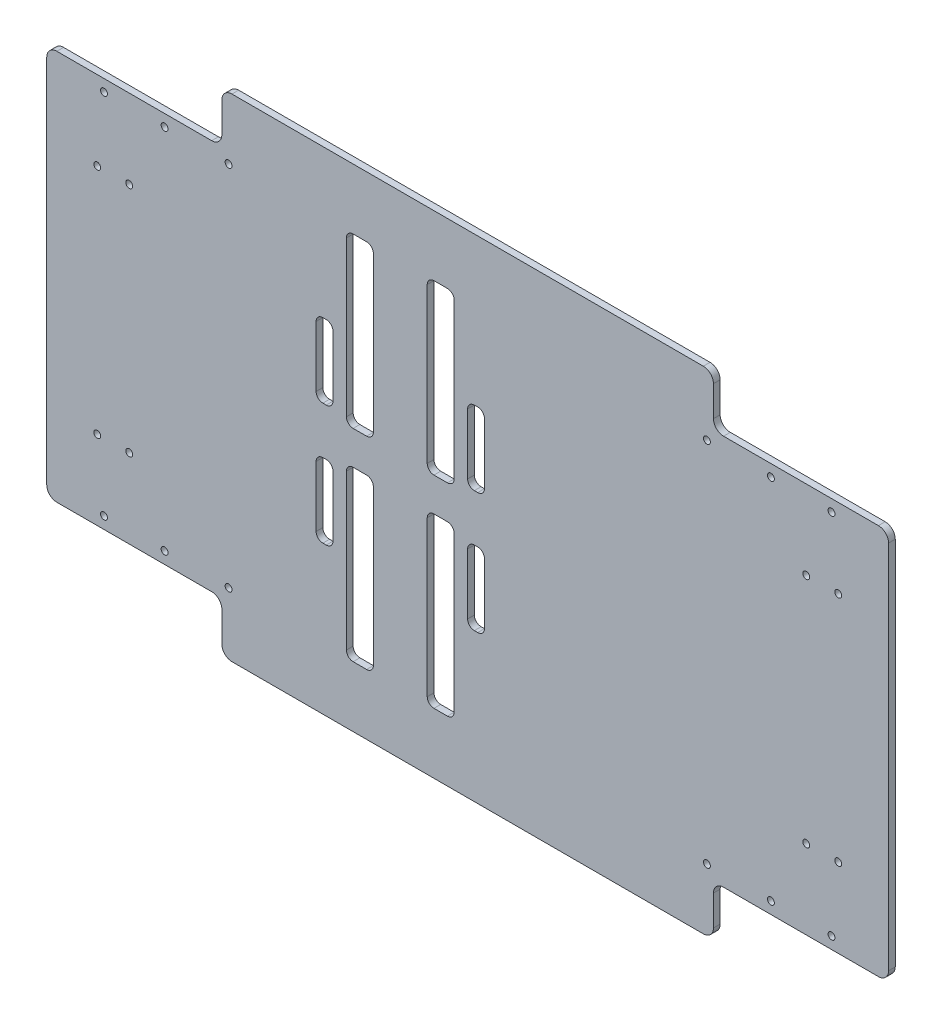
from build123d import *

# Parameters (mm, degrees)
SKETCH_1_W               = 8
SKETCH_1_H               = 50
SKETCH_1_W_2             = 5
SKETCH_1_H_2             = 22
EXTRUDE_1_DEPTH          = 2
FILLET_1_R               = 3
FILLET_2_R               = 2
HOLE_WIZARD_M2_5_1_D     = 2.05
HOLE_WIZARD_M2_5_1_DEPTH = 2
HOLE_WIZARD_M2_5_1_TIP   = 0.615882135
HOLE_WIZARD_M2_5_2_D     = 2.05
HOLE_WIZARD_M2_5_2_DEPTH = 3.35
HOLE_WIZARD_M2_5_2_TIP   = 0.615882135


with BuildPart() as part:
    # Sketch 1 → Extrude 1 (new body)
    with BuildSketch(Plane.XY):
        Polygon((73, 73), (-73, 73), (-73, 58), (-125, 58), (-125, -58), (-73, -58), (-73, -73), (73, -73), (73, -58), (125, -58), (125, 58), (73, 58), align=None)
        with Locations((-32, -30)):
            Rectangle(SKETCH_1_W, SKETCH_1_H, mode=Mode.SUBTRACT)
        with Locations((-8, -30)):
            Rectangle(SKETCH_1_W, SKETCH_1_H, mode=Mode.SUBTRACT)
        with Locations((-42.5, -18)):
            Rectangle(SKETCH_1_W_2, SKETCH_1_H_2, mode=Mode.SUBTRACT)
        with Locations((2.5, -18)):
            Rectangle(SKETCH_1_W_2, SKETCH_1_H_2, mode=Mode.SUBTRACT)
        with Locations((-42.5, 18)):
            Rectangle(SKETCH_1_W_2, SKETCH_1_H_2, mode=Mode.SUBTRACT)
        with Locations((-32, 30)):
            Rectangle(SKETCH_1_W, SKETCH_1_H, mode=Mode.SUBTRACT)
        with Locations((-8, 30)):
            Rectangle(SKETCH_1_W, SKETCH_1_H, mode=Mode.SUBTRACT)
        with Locations((2.5, 18)):
            Rectangle(SKETCH_1_W_2, SKETCH_1_H_2, mode=Mode.SUBTRACT)
    extrude(amount=EXTRUDE_1_DEPTH)

    # Fillet 1
    fillet_1_edges = [part.edges().sort_by_distance(p)[0] for p in [
        (125, -58, 1),
        (73, -58, 1),
        (73, -73, 1),
        (-73, -73, 1),
        (-73, -58, 1),
        (-125, -58, 1),
        (-125, 58, 1),
        (-73, 58, 1),
        (-73, 73, 1),
        (73, 73, 1),
        (73, 58, 1),
        (125, 58, 1),
    ]]
    fillet(fillet_1_edges, radius=FILLET_1_R)

    # Fillet 2
    fillet_2_edges = [part.edges().sort_by_distance(p)[0] for p in [
        (-28, -55, 1),
        (-28, -5, 1),
        (-36, -5, 1),
        (-36, -55, 1),
        (-40, -29, 1),
        (-40, -7, 1),
        (-45, -7, 1),
        (-45, -29, 1),
        (-12, 55, 1),
        (-12, 5, 1),
        (-4, 5, 1),
        (-4, 55, 1),
        (0, 29, 1),
        (0, 7, 1),
        (5, 7, 1),
        (5, 29, 1),
        (-45, 29, 1),
        (-45, 7, 1),
        (-40, 7, 1),
        (-40, 29, 1),
        (-36, 55, 1),
        (-36, 5, 1),
        (-28, 5, 1),
        (-28, 55, 1),
        (0, -7, 1),
        (0, -29, 1),
        (5, -29, 1),
        (5, -7, 1),
        (-12, -5, 1),
        (-12, -55, 1),
        (-4, -55, 1),
        (-4, -5, 1),
    ]]
    fillet(fillet_2_edges, radius=FILLET_2_R)

    # Hole Wizard M2.5 _1
    with Locations(Plane(origin=(0, 0, 0), x_dir=(-1, 0, 0), z_dir=(0, 0, -1))):
        with Locations((110, 34.5), (100.5, 34.5), (108, 54.5), (90, 54.5), (71, 54.5), (110, -34.5), (100.5, -34.5), (71, -54.5), (90, -54.5), (108, -54.5)):
            Hole(HOLE_WIZARD_M2_5_1_D / 2, depth=HOLE_WIZARD_M2_5_1_DEPTH)
            with Locations((0, 0, -(HOLE_WIZARD_M2_5_1_DEPTH + HOLE_WIZARD_M2_5_1_TIP / 2))):  # 118° drill point
                Cone(0, HOLE_WIZARD_M2_5_1_D / 2, HOLE_WIZARD_M2_5_1_TIP, mode=Mode.SUBTRACT)

    # Hole Wizard M2.5 _2
    with Locations(Plane(origin=(0, 0, 0), x_dir=(-1, 0, 0), z_dir=(0, 0, -1))):
        with Locations((-108.07179677, 54.5), (-90.07179677, 54.5), (-71.07179677, 54.5), (-100.57179677, 34.5), (-110.07179677, 34.5), (-110.07179677, -34.5), (-100.57179677, -34.5), (-108.07179677, -54.5), (-90.07179677, -54.5), (-71.07179677, -54.5)):
            Hole(HOLE_WIZARD_M2_5_2_D / 2, depth=HOLE_WIZARD_M2_5_2_DEPTH)
            with Locations((0, 0, -(HOLE_WIZARD_M2_5_2_DEPTH + HOLE_WIZARD_M2_5_2_TIP / 2))):  # 118° drill point
                Cone(0, HOLE_WIZARD_M2_5_2_D / 2, HOLE_WIZARD_M2_5_2_TIP, mode=Mode.SUBTRACT)


solid = part.part
